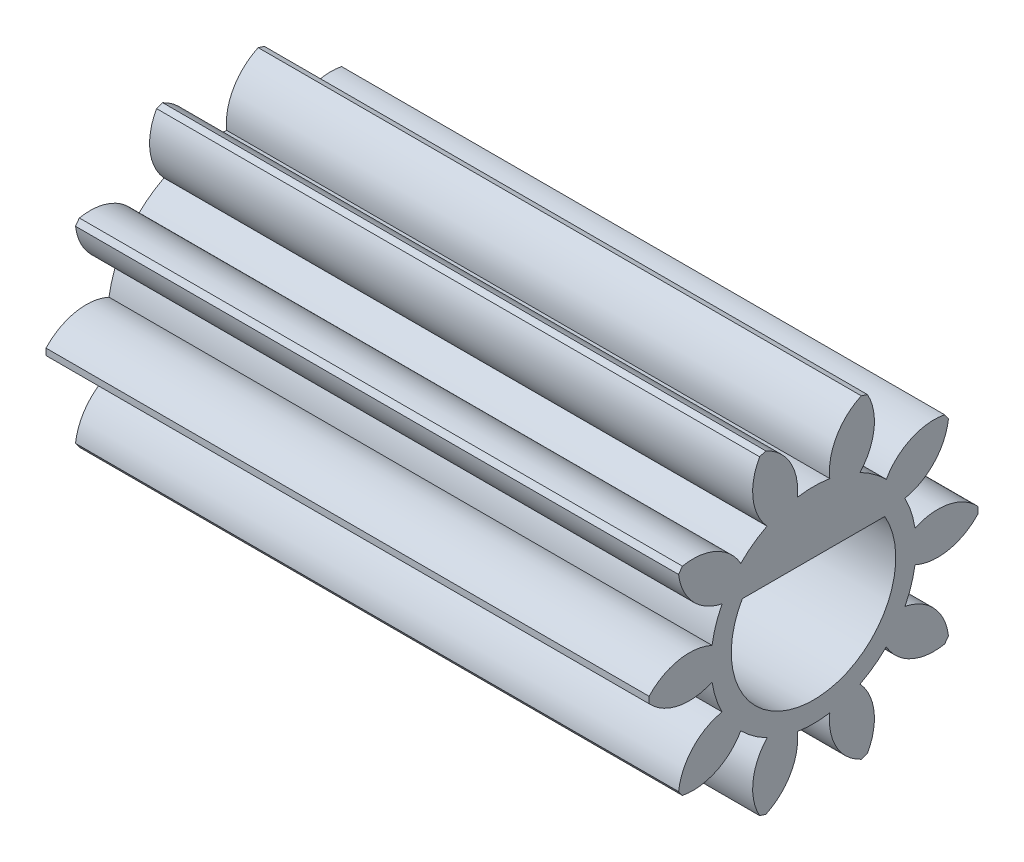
ISO-10303-21;
HEADER;
FILE_DESCRIPTION(('STEP AP214'),'2;1');
FILE_NAME('part.step','',(''),(''),'','','');
FILE_SCHEMA(('AUTOMOTIVE_DESIGN { 1 0 10303 214 1 1 1 1 }'));
ENDSEC;
DATA;
#1=APPLICATION_CONTEXT('core data for automotive mechanical design processes');
#2=APPLICATION_PROTOCOL_DEFINITION('international standard','automotive_design',2000,#1);
#3=PRODUCT_CONTEXT('',#1,'mechanical');
#4=PRODUCT('Part','Part','',(#3));
#5=PRODUCT_RELATED_PRODUCT_CATEGORY('part','',(#4));
#6=PRODUCT_DEFINITION_FORMATION('','',#4);
#7=PRODUCT_DEFINITION_CONTEXT('part definition',#1,'design');
#8=PRODUCT_DEFINITION('design','',#6,#7);
#9=PRODUCT_DEFINITION_SHAPE('','',#8);
#10=(LENGTH_UNIT() NAMED_UNIT(*) SI_UNIT(.MILLI.,.METRE.));
#11=(NAMED_UNIT(*) PLANE_ANGLE_UNIT() SI_UNIT($,.RADIAN.));
#12=(NAMED_UNIT(*) SI_UNIT($,.STERADIAN.) SOLID_ANGLE_UNIT());
#13=UNCERTAINTY_MEASURE_WITH_UNIT(LENGTH_MEASURE(1.E-05),#10,'distance_accuracy_value','');
#14=(GEOMETRIC_REPRESENTATION_CONTEXT(3) GLOBAL_UNCERTAINTY_ASSIGNED_CONTEXT((#13)) GLOBAL_UNIT_ASSIGNED_CONTEXT((#10,
#11,#12)) REPRESENTATION_CONTEXT('',''));
#15=CARTESIAN_POINT('',(0.,0.,0.));
#16=DIRECTION('',(0.,0.,1.));
#17=DIRECTION('',(1.,0.,0.));
#18=AXIS2_PLACEMENT_3D('',#15,#16,#17);
#19=CARTESIAN_POINT('',(11.,0.,0.));
#20=DIRECTION('',(-1.,0.,0.));
#21=DIRECTION('',(0.,0.,1.));
#22=AXIS2_PLACEMENT_3D('',#19,#20,#21);
#23=PLANE('',#22);
#24=CARTESIAN_POINT('',(11.,0.830089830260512,-2.19768964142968));
#25=DIRECTION('',(-1.,0.,0.));
#26=DIRECTION('',(0.,-0.587785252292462,-0.809016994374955));
#27=AXIS2_PLACEMENT_3D('',#24,#25,#26);
#28=CIRCLE('',#27,1.);
#29=CARTESIAN_POINT('',(11.,1.32275904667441,-1.32747297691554));
#30=VERTEX_POINT('',#29);
#31=CARTESIAN_POINT('',(11.,1.81110260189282,-2.39163278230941));
#32=VERTEX_POINT('',#31);
#33=EDGE_CURVE('E319',#30,#32,#28,.T.);
#34=ORIENTED_EDGE('',*,*,#33,.F.);
#35=CARTESIAN_POINT('',(11.,0.,0.));
#36=DIRECTION('',(-1.,0.,0.));
#37=DIRECTION('',(0.,-0.587785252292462,-0.809016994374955));
#38=AXIS2_PLACEMENT_3D('',#35,#36,#37);
#39=CIRCLE('',#38,1.874);
#40=CARTESIAN_POINT('',(11.,1.67125684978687,-0.84780690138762));
#41=VERTEX_POINT('',#40);
#42=EDGE_CURVE('E323',#41,#30,#39,.T.);
#43=ORIENTED_EDGE('',*,*,#42,.F.);
#44=CARTESIAN_POINT('',(11.,2.34663891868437,-0.110338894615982));
#45=DIRECTION('',(-1.,0.,0.));
#46=DIRECTION('',(0.,-0.587785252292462,-0.809016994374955));
#47=AXIS2_PLACEMENT_3D('',#44,#45,#46);
#48=CIRCLE('',#47,1.);
#49=CARTESIAN_POINT('',(11.,2.83423942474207,-0.983405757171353));
#50=VERTEX_POINT('',#49);
#51=EDGE_CURVE('E321',#50,#41,#48,.T.);
#52=ORIENTED_EDGE('',*,*,#51,.F.);
#53=CARTESIAN_POINT('',(11.,0.,0.));
#54=DIRECTION('',(-1.,0.,0.));
#55=DIRECTION('',(0.,0.,1.));
#56=AXIS2_PLACEMENT_3D('',#53,#54,#55);
#57=CIRCLE('',#56,3.);
#58=CARTESIAN_POINT('',(11.,2.87097926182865,-0.870332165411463));
#59=VERTEX_POINT('',#58);
#60=EDGE_CURVE('E539',#59,#50,#57,.T.);
#61=ORIENTED_EDGE('',*,*,#60,.F.);
#62=CARTESIAN_POINT('',(11.,1.96332633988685,-1.29005370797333));
#63=DIRECTION('',(-1.,0.,0.));
#64=DIRECTION('',(0.,0.,-1.));
#65=AXIS2_PLACEMENT_3D('',#62,#63,#64);
#66=CIRCLE('',#65,1.);
#67=CARTESIAN_POINT('',(11.,1.85040358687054,-0.296449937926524));
#68=VERTEX_POINT('',#67);
#69=EDGE_CURVE('E517',#68,#59,#66,.T.);
#70=ORIENTED_EDGE('',*,*,#69,.F.);
#71=CARTESIAN_POINT('',(11.,0.,0.));
#72=DIRECTION('',(-1.,0.,0.));
#73=DIRECTION('',(0.,0.,-1.));
#74=AXIS2_PLACEMENT_3D('',#71,#72,#73);
#75=CIRCLE('',#74,1.874);
#76=CARTESIAN_POINT('',(11.,1.85040358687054,0.296449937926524));
#77=VERTEX_POINT('',#76);
#78=EDGE_CURVE('E521',#77,#68,#75,.T.);
#79=ORIENTED_EDGE('',*,*,#78,.F.);
#80=CARTESIAN_POINT('',(11.,1.96332633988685,1.29005370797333));
#81=DIRECTION('',(-1.,0.,0.));
#82=DIRECTION('',(0.,0.,-1.));
#83=AXIS2_PLACEMENT_3D('',#80,#81,#82);
#84=CIRCLE('',#83,1.);
#85=CARTESIAN_POINT('',(11.,2.87097926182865,0.870332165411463));
#86=VERTEX_POINT('',#85);
#87=EDGE_CURVE('E519',#86,#77,#84,.T.);
#88=ORIENTED_EDGE('',*,*,#87,.F.);
#89=CARTESIAN_POINT('',(11.,2.83423942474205,0.983405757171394));
#90=VERTEX_POINT('',#89);
#91=EDGE_CURVE('E537',#90,#86,#57,.T.);
#92=ORIENTED_EDGE('',*,*,#91,.F.);
#93=CARTESIAN_POINT('',(11.,2.34663891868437,0.110338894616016));
#94=DIRECTION('',(-1.,0.,0.));
#95=DIRECTION('',(0.,0.587785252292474,-0.809016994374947));
#96=AXIS2_PLACEMENT_3D('',#93,#94,#95);
#97=CIRCLE('',#96,1.);
#98=CARTESIAN_POINT('',(11.,1.67125684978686,0.847806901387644));
#99=VERTEX_POINT('',#98);
#100=EDGE_CURVE('E495',#99,#90,#97,.T.);
#101=ORIENTED_EDGE('',*,*,#100,.F.);
#102=CARTESIAN_POINT('',(11.,0.,0.));
#103=DIRECTION('',(-1.,0.,0.));
#104=DIRECTION('',(0.,0.587785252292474,-0.809016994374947));
#105=AXIS2_PLACEMENT_3D('',#102,#103,#104);
#106=CIRCLE('',#105,1.874);
#107=CARTESIAN_POINT('',(11.,1.3227590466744,1.32747297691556));
#108=VERTEX_POINT('',#107);
#109=EDGE_CURVE('E499',#108,#99,#106,.T.);
#110=ORIENTED_EDGE('',*,*,#109,.F.);
#111=CARTESIAN_POINT('',(11.,0.83008983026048,2.19768964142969));
#112=DIRECTION('',(-1.,0.,0.));
#113=DIRECTION('',(0.,0.587785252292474,-0.809016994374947));
#114=AXIS2_PLACEMENT_3D('',#111,#112,#113);
#115=CIRCLE('',#114,1.);
#116=CARTESIAN_POINT('',(11.,1.81110260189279,2.39163278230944));
#117=VERTEX_POINT('',#116);
#118=EDGE_CURVE('E497',#117,#108,#115,.T.);
#119=ORIENTED_EDGE('',*,*,#118,.F.);
#120=CARTESIAN_POINT('',(11.,1.71491645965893,2.4615161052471));
#121=VERTEX_POINT('',#120);
#122=EDGE_CURVE('E609',#121,#117,#57,.T.);
#123=ORIENTED_EDGE('',*,*,#122,.F.);
#124=CARTESIAN_POINT('',(11.,1.83361518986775,1.46858578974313));
#125=DIRECTION('',(-1.,0.,0.));
#126=DIRECTION('',(0.,0.951056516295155,-0.309016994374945));
#127=AXIS2_PLACEMENT_3D('',#124,#125,#126);
#128=CIRCLE('',#127,1.);
#129=CARTESIAN_POINT('',(11.,0.853746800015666,1.66823032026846));
#130=VERTEX_POINT('',#129);
#131=EDGE_CURVE('E473',#130,#121,#128,.T.);
#132=ORIENTED_EDGE('',*,*,#131,.F.);
#133=CARTESIAN_POINT('',(11.,0.,0.));
#134=DIRECTION('',(-1.,0.,0.));
#135=DIRECTION('',(0.,0.951056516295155,-0.309016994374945));
#136=AXIS2_PLACEMENT_3D('',#133,#134,#135);
#137=CIRCLE('',#136,1.874);
#138=CARTESIAN_POINT('',(11.,0.289865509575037,1.85144645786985));
#139=VERTEX_POINT('',#138);
#140=EDGE_CURVE('E477',#139,#130,#137,.T.);
#141=ORIENTED_EDGE('',*,*,#140,.F.);
#142=CARTESIAN_POINT('',(11.,-0.620212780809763,2.26588282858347));
#143=DIRECTION('',(-1.,0.,0.));
#144=DIRECTION('',(0.,0.951056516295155,-0.309016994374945));
#145=AXIS2_PLACEMENT_3D('',#142,#143,#144);
#146=CIRCLE('',#145,1.);
#147=CARTESIAN_POINT('',(11.,0.0594463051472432,2.99941096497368));
#148=VERTEX_POINT('',#147);
#149=EDGE_CURVE('E475',#148,#139,#146,.T.);
#150=ORIENTED_EDGE('',*,*,#149,.F.);
#151=CARTESIAN_POINT('',(11.,-0.0594463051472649,2.99941096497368));
#152=VERTEX_POINT('',#151);
#153=EDGE_CURVE('E610',#152,#148,#57,.T.);
#154=ORIENTED_EDGE('',*,*,#153,.F.);
#155=CARTESIAN_POINT('',(11.,0.620212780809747,2.26588282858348));
#156=DIRECTION('',(-1.,0.,0.));
#157=DIRECTION('',(0.,0.951056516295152,0.309016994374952));
#158=AXIS2_PLACEMENT_3D('',#155,#156,#157);
#159=CIRCLE('',#158,1.);
#160=CARTESIAN_POINT('',(11.,-0.28986550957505,1.85144645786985));
#161=VERTEX_POINT('',#160);
#162=EDGE_CURVE('E451',#161,#152,#159,.T.);
#163=ORIENTED_EDGE('',*,*,#162,.F.);
#164=CARTESIAN_POINT('',(11.,0.,0.));
#165=DIRECTION('',(-1.,0.,0.));
#166=DIRECTION('',(0.,0.951056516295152,0.309016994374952));
#167=AXIS2_PLACEMENT_3D('',#164,#165,#166);
#168=CIRCLE('',#167,1.874);
#169=CARTESIAN_POINT('',(11.,-0.853746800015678,1.66823032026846));
#170=VERTEX_POINT('',#169);
#171=EDGE_CURVE('E455',#170,#161,#168,.T.);
#172=ORIENTED_EDGE('',*,*,#171,.F.);
#173=CARTESIAN_POINT('',(11.,-1.83361518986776,1.46858578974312));
#174=DIRECTION('',(-1.,0.,0.));
#175=DIRECTION('',(0.,0.951056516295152,0.309016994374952));
#176=AXIS2_PLACEMENT_3D('',#173,#174,#175);
#177=CIRCLE('',#176,1.);
#178=CARTESIAN_POINT('',(11.,-1.71491645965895,2.46151610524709));
#179=VERTEX_POINT('',#178);
#180=EDGE_CURVE('E453',#179,#170,#177,.T.);
#181=ORIENTED_EDGE('',*,*,#180,.F.);
#182=CARTESIAN_POINT('',(11.,-1.8111026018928,2.39163278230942));
#183=VERTEX_POINT('',#182);
#184=EDGE_CURVE('E614',#183,#179,#57,.T.);
#185=ORIENTED_EDGE('',*,*,#184,.F.);
#186=CARTESIAN_POINT('',(11.,-0.830089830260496,2.19768964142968));
#187=DIRECTION('',(-1.,0.,0.));
#188=DIRECTION('',(0.,0.587785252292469,0.809016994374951));
#189=AXIS2_PLACEMENT_3D('',#186,#187,#188);
#190=CIRCLE('',#189,1.);
#191=CARTESIAN_POINT('',(11.,-1.3227590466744,1.32747297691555));
#192=VERTEX_POINT('',#191);
#193=EDGE_CURVE('E429',#192,#183,#190,.T.);
#194=ORIENTED_EDGE('',*,*,#193,.F.);
#195=CARTESIAN_POINT('',(11.,0.,0.));
#196=DIRECTION('',(-1.,0.,0.));
#197=DIRECTION('',(0.,0.587785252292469,0.809016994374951));
#198=AXIS2_PLACEMENT_3D('',#195,#196,#197);
#199=CIRCLE('',#198,1.874);
#200=CARTESIAN_POINT('',(11.,-1.67125684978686,0.847806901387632));
#201=VERTEX_POINT('',#200);
#202=EDGE_CURVE('E433',#201,#192,#199,.T.);
#203=ORIENTED_EDGE('',*,*,#202,.F.);
#204=CARTESIAN_POINT('',(11.,-2.34663891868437,0.110338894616));
#205=DIRECTION('',(-1.,0.,0.));
#206=DIRECTION('',(0.,0.587785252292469,0.809016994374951));
#207=AXIS2_PLACEMENT_3D('',#204,#205,#206);
#208=CIRCLE('',#207,1.);
#209=CARTESIAN_POINT('',(11.,-2.83423942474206,0.983405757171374));
#210=VERTEX_POINT('',#209);
#211=EDGE_CURVE('E431',#210,#201,#208,.T.);
#212=ORIENTED_EDGE('',*,*,#211,.F.);
#213=CARTESIAN_POINT('',(11.,-2.87097926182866,0.870332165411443));
#214=VERTEX_POINT('',#213);
#215=EDGE_CURVE('E619',#214,#210,#57,.T.);
#216=ORIENTED_EDGE('',*,*,#215,.F.);
#217=CARTESIAN_POINT('',(11.,-1.96332633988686,1.29005370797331));
#218=DIRECTION('',(-1.,0.,0.));
#219=DIRECTION('',(0.,0.,1.));
#220=AXIS2_PLACEMENT_3D('',#217,#218,#219);
#221=CIRCLE('',#220,1.);
#222=CARTESIAN_POINT('',(11.,-1.85040358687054,0.296449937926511));
#223=VERTEX_POINT('',#222);
#224=EDGE_CURVE('E407',#223,#214,#221,.T.);
#225=ORIENTED_EDGE('',*,*,#224,.F.);
#226=CARTESIAN_POINT('',(11.,0.,0.));
#227=DIRECTION('',(-1.,0.,0.));
#228=DIRECTION('',(0.,0.,1.));
#229=AXIS2_PLACEMENT_3D('',#226,#227,#228);
#230=CIRCLE('',#229,1.874);
#231=CARTESIAN_POINT('',(11.,-1.85040358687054,-0.296449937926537));
#232=VERTEX_POINT('',#231);
#233=EDGE_CURVE('E411',#232,#223,#230,.T.);
#234=ORIENTED_EDGE('',*,*,#233,.F.);
#235=CARTESIAN_POINT('',(11.,-1.96332633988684,-1.29005370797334));
#236=DIRECTION('',(-1.,0.,0.));
#237=DIRECTION('',(0.,0.,1.));
#238=AXIS2_PLACEMENT_3D('',#235,#236,#237);
#239=CIRCLE('',#238,1.);
#240=CARTESIAN_POINT('',(11.,-2.87097926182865,-0.870332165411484));
#241=VERTEX_POINT('',#240);
#242=EDGE_CURVE('E409',#241,#232,#239,.T.);
#243=ORIENTED_EDGE('',*,*,#242,.F.);
#244=CARTESIAN_POINT('',(11.,-2.83423942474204,-0.983405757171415));
#245=VERTEX_POINT('',#244);
#246=EDGE_CURVE('E624',#245,#241,#57,.T.);
#247=ORIENTED_EDGE('',*,*,#246,.F.);
#248=CARTESIAN_POINT('',(11.,-2.34663891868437,-0.110338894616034));
#249=DIRECTION('',(-1.,0.,0.));
#250=DIRECTION('',(0.,-0.58778525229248,0.809016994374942));
#251=AXIS2_PLACEMENT_3D('',#248,#249,#250);
#252=CIRCLE('',#251,1.);
#253=CARTESIAN_POINT('',(11.,-1.67125684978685,-0.847806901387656));
#254=VERTEX_POINT('',#253);
#255=EDGE_CURVE('E385',#254,#245,#252,.T.);
#256=ORIENTED_EDGE('',*,*,#255,.F.);
#257=CARTESIAN_POINT('',(11.,0.,0.));
#258=DIRECTION('',(-1.,0.,0.));
#259=DIRECTION('',(0.,-0.58778525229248,0.809016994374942));
#260=AXIS2_PLACEMENT_3D('',#257,#258,#259);
#261=CIRCLE('',#260,1.874);
#262=CARTESIAN_POINT('',(11.,-1.32275904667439,-1.32747297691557));
#263=VERTEX_POINT('',#262);
#264=EDGE_CURVE('E389',#263,#254,#261,.T.);
#265=ORIENTED_EDGE('',*,*,#264,.F.);
#266=CARTESIAN_POINT('',(11.,-0.830089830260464,-2.19768964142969));
#267=DIRECTION('',(-1.,0.,0.));
#268=DIRECTION('',(0.,-0.58778525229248,0.809016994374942));
#269=AXIS2_PLACEMENT_3D('',#266,#267,#268);
#270=CIRCLE('',#269,1.);
#271=CARTESIAN_POINT('',(11.,-1.81110260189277,-2.39163278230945));
#272=VERTEX_POINT('',#271);
#273=EDGE_CURVE('E387',#272,#263,#270,.T.);
#274=ORIENTED_EDGE('',*,*,#273,.F.);
#275=CARTESIAN_POINT('',(11.,-1.71491645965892,-2.46151610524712));
#276=VERTEX_POINT('',#275);
#277=EDGE_CURVE('E629',#276,#272,#57,.T.);
#278=ORIENTED_EDGE('',*,*,#277,.F.);
#279=CARTESIAN_POINT('',(11.,-1.83361518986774,-1.46858578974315));
#280=DIRECTION('',(-1.,0.,0.));
#281=DIRECTION('',(0.,-0.951056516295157,0.309016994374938));
#282=AXIS2_PLACEMENT_3D('',#279,#280,#281);
#283=CIRCLE('',#282,1.);
#284=CARTESIAN_POINT('',(11.,-0.853746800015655,-1.66823032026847));
#285=VERTEX_POINT('',#284);
#286=EDGE_CURVE('E363',#285,#276,#283,.T.);
#287=ORIENTED_EDGE('',*,*,#286,.F.);
#288=CARTESIAN_POINT('',(11.,0.,0.));
#289=DIRECTION('',(-1.,0.,0.));
#290=DIRECTION('',(0.,-0.951056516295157,0.309016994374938));
#291=AXIS2_PLACEMENT_3D('',#288,#289,#290);
#292=CIRCLE('',#291,1.874);
#293=CARTESIAN_POINT('',(11.,-0.289865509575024,-1.85144645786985));
#294=VERTEX_POINT('',#293);
#295=EDGE_CURVE('E367',#294,#285,#292,.T.);
#296=ORIENTED_EDGE('',*,*,#295,.F.);
#297=CARTESIAN_POINT('',(11.,0.620212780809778,-2.26588282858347));
#298=DIRECTION('',(-1.,0.,0.));
#299=DIRECTION('',(0.,-0.951056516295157,0.309016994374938));
#300=AXIS2_PLACEMENT_3D('',#297,#298,#299);
#301=CIRCLE('',#300,1.);
#302=CARTESIAN_POINT('',(11.,-0.0594463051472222,-2.99941096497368));
#303=VERTEX_POINT('',#302);
#304=EDGE_CURVE('E365',#303,#294,#301,.T.);
#305=ORIENTED_EDGE('',*,*,#304,.F.);
#306=CARTESIAN_POINT('',(11.,0.0594463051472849,-2.99941096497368));
#307=VERTEX_POINT('',#306);
#308=EDGE_CURVE('E634',#307,#303,#57,.T.);
#309=ORIENTED_EDGE('',*,*,#308,.F.);
#310=CARTESIAN_POINT('',(11.,-0.62021278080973,-2.26588282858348));
#311=DIRECTION('',(-1.,0.,0.));
#312=DIRECTION('',(0.,-0.95105651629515,-0.309016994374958));
#313=AXIS2_PLACEMENT_3D('',#310,#311,#312);
#314=CIRCLE('',#313,1.);
#315=CARTESIAN_POINT('',(11.,0.289865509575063,-1.85144645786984));
#316=VERTEX_POINT('',#315);
#317=EDGE_CURVE('E341',#316,#307,#314,.T.);
#318=ORIENTED_EDGE('',*,*,#317,.F.);
#319=CARTESIAN_POINT('',(11.,0.,0.));
#320=DIRECTION('',(-1.,0.,0.));
#321=DIRECTION('',(0.,-0.95105651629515,-0.309016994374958));
#322=AXIS2_PLACEMENT_3D('',#319,#320,#321);
#323=CIRCLE('',#322,1.874);
#324=CARTESIAN_POINT('',(11.,0.85374680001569,-1.66823032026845));
#325=VERTEX_POINT('',#324);
#326=EDGE_CURVE('E345',#325,#316,#323,.T.);
#327=ORIENTED_EDGE('',*,*,#326,.F.);
#328=CARTESIAN_POINT('',(11.,1.83361518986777,-1.46858578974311));
#329=DIRECTION('',(-1.,0.,0.));
#330=DIRECTION('',(0.,-0.95105651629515,-0.309016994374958));
#331=AXIS2_PLACEMENT_3D('',#328,#329,#330);
#332=CIRCLE('',#331,1.);
#333=CARTESIAN_POINT('',(11.,1.71491645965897,-2.46151610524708));
#334=VERTEX_POINT('',#333);
#335=EDGE_CURVE('E343',#334,#325,#332,.T.);
#336=ORIENTED_EDGE('',*,*,#335,.F.);
#337=EDGE_CURVE('E543',#32,#334,#57,.T.);
#338=ORIENTED_EDGE('',*,*,#337,.F.);
#339=EDGE_LOOP('',(#34,#43,#52,#61,#70,#79,#88,#92,#101,#110,#119,#123,#132,#141,#150,#154,#163,
#172,#181,#185,#194,#203,#212,#216,#225,#234,#243,#247,#256,#265,#274,#278,#287,#296,#305,#309,
#318,#327,#336,#338));
#340=FACE_BOUND('',#339,.T.);
#341=CARTESIAN_POINT('',(11.,0.,0.));
#342=DIRECTION('',(-1.,0.,0.));
#343=DIRECTION('',(0.,0.,1.));
#344=AXIS2_PLACEMENT_3D('',#341,#342,#343);
#345=CIRCLE('',#344,1.5);
#346=CARTESIAN_POINT('',(11.,0.75,1.29903810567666));
#347=VERTEX_POINT('',#346);
#348=CARTESIAN_POINT('',(11.,0.75,-1.29903810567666));
#349=VERTEX_POINT('',#348);
#350=EDGE_CURVE('E300',#347,#349,#345,.F.);
#351=ORIENTED_EDGE('',*,*,#350,.F.);
#352=DIRECTION('',(0.,0.,1.));
#353=VECTOR('',#352,1.);
#354=CARTESIAN_POINT('',(11.,0.75,0.));
#355=LINE('',#354,#353);
#356=EDGE_CURVE('E296',#349,#347,#355,.T.);
#357=ORIENTED_EDGE('',*,*,#356,.F.);
#358=EDGE_LOOP('',(#351,#357));
#359=FACE_BOUND('',#358,.T.);
#360=ADVANCED_FACE('F32',(#340,#359),#23,.F.);
#361=CARTESIAN_POINT('',(0.,0.,0.));
#362=DIRECTION('',(1.,0.,0.));
#363=DIRECTION('',(0.,0.,-1.));
#364=AXIS2_PLACEMENT_3D('',#361,#362,#363);
#365=PLANE('',#364);
#366=CARTESIAN_POINT('',(0.,0.830089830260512,-2.19768964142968));
#367=DIRECTION('',(-1.,0.,0.));
#368=DIRECTION('',(0.,-0.587785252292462,-0.809016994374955));
#369=AXIS2_PLACEMENT_3D('',#366,#367,#368);
#370=CIRCLE('',#369,1.);
#371=CARTESIAN_POINT('',(0.,1.32275904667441,-1.32747297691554));
#372=VERTEX_POINT('',#371);
#373=CARTESIAN_POINT('',(0.,1.81110260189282,-2.39163278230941));
#374=VERTEX_POINT('',#373);
#375=EDGE_CURVE('E308',#372,#374,#370,.T.);
#376=ORIENTED_EDGE('',*,*,#375,.T.);
#377=CARTESIAN_POINT('',(0.,0.,0.));
#378=DIRECTION('',(-1.,0.,0.));
#379=DIRECTION('',(0.,0.,1.));
#380=AXIS2_PLACEMENT_3D('',#377,#378,#379);
#381=CIRCLE('',#380,3.);
#382=CARTESIAN_POINT('',(0.,1.71491645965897,-2.46151610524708));
#383=VERTEX_POINT('',#382);
#384=EDGE_CURVE('E538',#374,#383,#381,.T.);
#385=ORIENTED_EDGE('',*,*,#384,.T.);
#386=CARTESIAN_POINT('',(0.,1.83361518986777,-1.46858578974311));
#387=DIRECTION('',(1.,0.,0.));
#388=DIRECTION('',(0.,0.,-1.));
#389=AXIS2_PLACEMENT_3D('',#386,#387,#388);
#390=CIRCLE('',#389,1.);
#391=CARTESIAN_POINT('',(0.,0.85374680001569,-1.66823032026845));
#392=VERTEX_POINT('',#391);
#393=EDGE_CURVE('E567',#392,#383,#390,.T.);
#394=ORIENTED_EDGE('',*,*,#393,.F.);
#395=CARTESIAN_POINT('',(0.,0.,0.));
#396=DIRECTION('',(-1.,0.,0.));
#397=DIRECTION('',(0.,-0.95105651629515,-0.309016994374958));
#398=AXIS2_PLACEMENT_3D('',#395,#396,#397);
#399=CIRCLE('',#398,1.874);
#400=CARTESIAN_POINT('',(0.,0.289865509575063,-1.85144645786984));
#401=VERTEX_POINT('',#400);
#402=EDGE_CURVE('E338',#392,#401,#399,.T.);
#403=ORIENTED_EDGE('',*,*,#402,.T.);
#404=CARTESIAN_POINT('',(0.,-0.62021278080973,-2.26588282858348));
#405=DIRECTION('',(-1.,0.,0.));
#406=DIRECTION('',(0.,-0.95105651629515,-0.309016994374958));
#407=AXIS2_PLACEMENT_3D('',#404,#405,#406);
#408=CIRCLE('',#407,1.);
#409=CARTESIAN_POINT('',(0.,0.0594463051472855,-2.99941096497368));
#410=VERTEX_POINT('',#409);
#411=EDGE_CURVE('E335',#401,#410,#408,.T.);
#412=ORIENTED_EDGE('',*,*,#411,.T.);
#413=CARTESIAN_POINT('',(0.,-0.0594463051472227,-2.99941096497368));
#414=VERTEX_POINT('',#413);
#415=EDGE_CURVE('E662',#410,#414,#381,.T.);
#416=ORIENTED_EDGE('',*,*,#415,.T.);
#417=CARTESIAN_POINT('',(0.,0.620212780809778,-2.26588282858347));
#418=DIRECTION('',(1.,0.,0.));
#419=DIRECTION('',(0.,0.,-1.));
#420=AXIS2_PLACEMENT_3D('',#417,#418,#419);
#421=CIRCLE('',#420,1.);
#422=CARTESIAN_POINT('',(0.,-0.289865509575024,-1.85144645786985));
#423=VERTEX_POINT('',#422);
#424=EDGE_CURVE('E564',#423,#414,#421,.T.);
#425=ORIENTED_EDGE('',*,*,#424,.F.);
#426=CARTESIAN_POINT('',(0.,0.,0.));
#427=DIRECTION('',(-1.,0.,0.));
#428=DIRECTION('',(0.,-0.951056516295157,0.309016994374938));
#429=AXIS2_PLACEMENT_3D('',#426,#427,#428);
#430=CIRCLE('',#429,1.874);
#431=CARTESIAN_POINT('',(0.,-0.853746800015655,-1.66823032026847));
#432=VERTEX_POINT('',#431);
#433=EDGE_CURVE('E360',#423,#432,#430,.T.);
#434=ORIENTED_EDGE('',*,*,#433,.T.);
#435=CARTESIAN_POINT('',(0.,-1.83361518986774,-1.46858578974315));
#436=DIRECTION('',(-1.,0.,0.));
#437=DIRECTION('',(0.,-0.951056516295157,0.309016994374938));
#438=AXIS2_PLACEMENT_3D('',#435,#436,#437);
#439=CIRCLE('',#438,1.);
#440=CARTESIAN_POINT('',(0.,-1.71491645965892,-2.46151610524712));
#441=VERTEX_POINT('',#440);
#442=EDGE_CURVE('E357',#432,#441,#439,.T.);
#443=ORIENTED_EDGE('',*,*,#442,.T.);
#444=CARTESIAN_POINT('',(0.,-1.81110260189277,-2.39163278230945));
#445=VERTEX_POINT('',#444);
#446=EDGE_CURVE('E664',#441,#445,#381,.T.);
#447=ORIENTED_EDGE('',*,*,#446,.T.);
#448=CARTESIAN_POINT('',(0.,-0.830089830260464,-2.19768964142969));
#449=DIRECTION('',(1.,0.,0.));
#450=DIRECTION('',(0.,0.,-1.));
#451=AXIS2_PLACEMENT_3D('',#448,#449,#450);
#452=CIRCLE('',#451,1.);
#453=CARTESIAN_POINT('',(0.,-1.32275904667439,-1.32747297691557));
#454=VERTEX_POINT('',#453);
#455=EDGE_CURVE('E561',#454,#445,#452,.T.);
#456=ORIENTED_EDGE('',*,*,#455,.F.);
#457=CARTESIAN_POINT('',(0.,0.,0.));
#458=DIRECTION('',(-1.,0.,0.));
#459=DIRECTION('',(0.,-0.58778525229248,0.809016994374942));
#460=AXIS2_PLACEMENT_3D('',#457,#458,#459);
#461=CIRCLE('',#460,1.874);
#462=CARTESIAN_POINT('',(0.,-1.67125684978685,-0.847806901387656));
#463=VERTEX_POINT('',#462);
#464=EDGE_CURVE('E382',#454,#463,#461,.T.);
#465=ORIENTED_EDGE('',*,*,#464,.T.);
#466=CARTESIAN_POINT('',(0.,-2.34663891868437,-0.110338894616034));
#467=DIRECTION('',(-1.,0.,0.));
#468=DIRECTION('',(0.,-0.58778525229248,0.809016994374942));
#469=AXIS2_PLACEMENT_3D('',#466,#467,#468);
#470=CIRCLE('',#469,1.);
#471=CARTESIAN_POINT('',(0.,-2.83423942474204,-0.983405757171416));
#472=VERTEX_POINT('',#471);
#473=EDGE_CURVE('E379',#463,#472,#470,.T.);
#474=ORIENTED_EDGE('',*,*,#473,.T.);
#475=CARTESIAN_POINT('',(0.,-2.87097926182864,-0.870332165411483));
#476=VERTEX_POINT('',#475);
#477=EDGE_CURVE('E665',#472,#476,#381,.T.);
#478=ORIENTED_EDGE('',*,*,#477,.T.);
#479=CARTESIAN_POINT('',(0.,-1.96332633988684,-1.29005370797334));
#480=DIRECTION('',(1.,0.,0.));
#481=DIRECTION('',(0.,0.,-1.));
#482=AXIS2_PLACEMENT_3D('',#479,#480,#481);
#483=CIRCLE('',#482,1.);
#484=CARTESIAN_POINT('',(0.,-1.85040358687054,-0.296449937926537));
#485=VERTEX_POINT('',#484);
#486=EDGE_CURVE('E558',#485,#476,#483,.T.);
#487=ORIENTED_EDGE('',*,*,#486,.F.);
#488=CARTESIAN_POINT('',(0.,0.,0.));
#489=DIRECTION('',(-1.,0.,0.));
#490=DIRECTION('',(0.,0.,1.));
#491=AXIS2_PLACEMENT_3D('',#488,#489,#490);
#492=CIRCLE('',#491,1.874);
#493=CARTESIAN_POINT('',(0.,-1.85040358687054,0.296449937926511));
#494=VERTEX_POINT('',#493);
#495=EDGE_CURVE('E404',#485,#494,#492,.T.);
#496=ORIENTED_EDGE('',*,*,#495,.T.);
#497=CARTESIAN_POINT('',(0.,-1.96332633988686,1.29005370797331));
#498=DIRECTION('',(-1.,0.,0.));
#499=DIRECTION('',(0.,0.,1.));
#500=AXIS2_PLACEMENT_3D('',#497,#498,#499);
#501=CIRCLE('',#500,1.);
#502=CARTESIAN_POINT('',(0.,-2.87097926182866,0.870332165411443));
#503=VERTEX_POINT('',#502);
#504=EDGE_CURVE('E401',#494,#503,#501,.T.);
#505=ORIENTED_EDGE('',*,*,#504,.T.);
#506=CARTESIAN_POINT('',(0.,-2.83423942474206,0.983405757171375));
#507=VERTEX_POINT('',#506);
#508=EDGE_CURVE('E668',#503,#507,#381,.T.);
#509=ORIENTED_EDGE('',*,*,#508,.T.);
#510=CARTESIAN_POINT('',(0.,-2.34663891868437,0.110338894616));
#511=DIRECTION('',(1.,0.,0.));
#512=DIRECTION('',(0.,0.,-1.));
#513=AXIS2_PLACEMENT_3D('',#510,#511,#512);
#514=CIRCLE('',#513,1.);
#515=CARTESIAN_POINT('',(0.,-1.67125684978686,0.847806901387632));
#516=VERTEX_POINT('',#515);
#517=EDGE_CURVE('E555',#516,#507,#514,.T.);
#518=ORIENTED_EDGE('',*,*,#517,.F.);
#519=CARTESIAN_POINT('',(0.,0.,0.));
#520=DIRECTION('',(-1.,0.,0.));
#521=DIRECTION('',(0.,0.587785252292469,0.809016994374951));
#522=AXIS2_PLACEMENT_3D('',#519,#520,#521);
#523=CIRCLE('',#522,1.874);
#524=CARTESIAN_POINT('',(0.,-1.3227590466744,1.32747297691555));
#525=VERTEX_POINT('',#524);
#526=EDGE_CURVE('E426',#516,#525,#523,.T.);
#527=ORIENTED_EDGE('',*,*,#526,.T.);
#528=CARTESIAN_POINT('',(0.,-0.830089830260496,2.19768964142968));
#529=DIRECTION('',(-1.,0.,0.));
#530=DIRECTION('',(0.,0.587785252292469,0.809016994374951));
#531=AXIS2_PLACEMENT_3D('',#528,#529,#530);
#532=CIRCLE('',#531,1.);
#533=CARTESIAN_POINT('',(0.,-1.8111026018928,2.39163278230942));
#534=VERTEX_POINT('',#533);
#535=EDGE_CURVE('E423',#525,#534,#532,.T.);
#536=ORIENTED_EDGE('',*,*,#535,.T.);
#537=CARTESIAN_POINT('',(0.,-1.71491645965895,2.46151610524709));
#538=VERTEX_POINT('',#537);
#539=EDGE_CURVE('E671',#534,#538,#381,.T.);
#540=ORIENTED_EDGE('',*,*,#539,.T.);
#541=CARTESIAN_POINT('',(0.,-1.83361518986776,1.46858578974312));
#542=DIRECTION('',(1.,0.,0.));
#543=DIRECTION('',(0.,0.,-1.));
#544=AXIS2_PLACEMENT_3D('',#541,#542,#543);
#545=CIRCLE('',#544,1.);
#546=CARTESIAN_POINT('',(0.,-0.853746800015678,1.66823032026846));
#547=VERTEX_POINT('',#546);
#548=EDGE_CURVE('E552',#547,#538,#545,.T.);
#549=ORIENTED_EDGE('',*,*,#548,.F.);
#550=CARTESIAN_POINT('',(0.,0.,0.));
#551=DIRECTION('',(-1.,0.,0.));
#552=DIRECTION('',(0.,0.951056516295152,0.309016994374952));
#553=AXIS2_PLACEMENT_3D('',#550,#551,#552);
#554=CIRCLE('',#553,1.874);
#555=CARTESIAN_POINT('',(0.,-0.28986550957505,1.85144645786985));
#556=VERTEX_POINT('',#555);
#557=EDGE_CURVE('E448',#547,#556,#554,.T.);
#558=ORIENTED_EDGE('',*,*,#557,.T.);
#559=CARTESIAN_POINT('',(0.,0.620212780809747,2.26588282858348));
#560=DIRECTION('',(-1.,0.,0.));
#561=DIRECTION('',(0.,0.951056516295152,0.309016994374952));
#562=AXIS2_PLACEMENT_3D('',#559,#560,#561);
#563=CIRCLE('',#562,1.);
#564=CARTESIAN_POINT('',(0.,-0.0594463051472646,2.99941096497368));
#565=VERTEX_POINT('',#564);
#566=EDGE_CURVE('E445',#556,#565,#563,.T.);
#567=ORIENTED_EDGE('',*,*,#566,.T.);
#568=CARTESIAN_POINT('',(0.,0.0594463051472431,2.99941096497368));
#569=VERTEX_POINT('',#568);
#570=EDGE_CURVE('E674',#565,#569,#381,.T.);
#571=ORIENTED_EDGE('',*,*,#570,.T.);
#572=CARTESIAN_POINT('',(0.,-0.620212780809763,2.26588282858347));
#573=DIRECTION('',(1.,0.,0.));
#574=DIRECTION('',(0.,0.,-1.));
#575=AXIS2_PLACEMENT_3D('',#572,#573,#574);
#576=CIRCLE('',#575,1.);
#577=CARTESIAN_POINT('',(0.,0.289865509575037,1.85144645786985));
#578=VERTEX_POINT('',#577);
#579=EDGE_CURVE('E549',#578,#569,#576,.T.);
#580=ORIENTED_EDGE('',*,*,#579,.F.);
#581=CARTESIAN_POINT('',(0.,0.,0.));
#582=DIRECTION('',(-1.,0.,0.));
#583=DIRECTION('',(0.,0.951056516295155,-0.309016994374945));
#584=AXIS2_PLACEMENT_3D('',#581,#582,#583);
#585=CIRCLE('',#584,1.874);
#586=CARTESIAN_POINT('',(0.,0.853746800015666,1.66823032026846));
#587=VERTEX_POINT('',#586);
#588=EDGE_CURVE('E470',#578,#587,#585,.T.);
#589=ORIENTED_EDGE('',*,*,#588,.T.);
#590=CARTESIAN_POINT('',(0.,1.83361518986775,1.46858578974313));
#591=DIRECTION('',(-1.,0.,0.));
#592=DIRECTION('',(0.,0.951056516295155,-0.309016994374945));
#593=AXIS2_PLACEMENT_3D('',#590,#591,#592);
#594=CIRCLE('',#593,1.);
#595=CARTESIAN_POINT('',(0.,1.71491645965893,2.4615161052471));
#596=VERTEX_POINT('',#595);
#597=EDGE_CURVE('E467',#587,#596,#594,.T.);
#598=ORIENTED_EDGE('',*,*,#597,.T.);
#599=CARTESIAN_POINT('',(0.,1.81110260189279,2.39163278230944));
#600=VERTEX_POINT('',#599);
#601=EDGE_CURVE('E677',#596,#600,#381,.T.);
#602=ORIENTED_EDGE('',*,*,#601,.T.);
#603=CARTESIAN_POINT('',(0.,0.83008983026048,2.19768964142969));
#604=DIRECTION('',(1.,0.,0.));
#605=DIRECTION('',(0.,0.,-1.));
#606=AXIS2_PLACEMENT_3D('',#603,#604,#605);
#607=CIRCLE('',#606,1.);
#608=CARTESIAN_POINT('',(0.,1.3227590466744,1.32747297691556));
#609=VERTEX_POINT('',#608);
#610=EDGE_CURVE('E546',#609,#600,#607,.T.);
#611=ORIENTED_EDGE('',*,*,#610,.F.);
#612=CARTESIAN_POINT('',(0.,0.,0.));
#613=DIRECTION('',(-1.,0.,0.));
#614=DIRECTION('',(0.,0.587785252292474,-0.809016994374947));
#615=AXIS2_PLACEMENT_3D('',#612,#613,#614);
#616=CIRCLE('',#615,1.874);
#617=CARTESIAN_POINT('',(0.,1.67125684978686,0.847806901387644));
#618=VERTEX_POINT('',#617);
#619=EDGE_CURVE('E492',#609,#618,#616,.T.);
#620=ORIENTED_EDGE('',*,*,#619,.T.);
#621=CARTESIAN_POINT('',(0.,2.34663891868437,0.110338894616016));
#622=DIRECTION('',(-1.,0.,0.));
#623=DIRECTION('',(0.,0.587785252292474,-0.809016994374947));
#624=AXIS2_PLACEMENT_3D('',#621,#622,#623);
#625=CIRCLE('',#624,1.);
#626=CARTESIAN_POINT('',(0.,2.83423942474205,0.983405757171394));
#627=VERTEX_POINT('',#626);
#628=EDGE_CURVE('E489',#618,#627,#625,.T.);
#629=ORIENTED_EDGE('',*,*,#628,.T.);
#630=CARTESIAN_POINT('',(0.,2.87097926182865,0.870332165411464));
#631=VERTEX_POINT('',#630);
#632=EDGE_CURVE('E533',#627,#631,#381,.T.);
#633=ORIENTED_EDGE('',*,*,#632,.T.);
#634=CARTESIAN_POINT('',(0.,1.96332633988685,1.29005370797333));
#635=DIRECTION('',(1.,0.,0.));
#636=DIRECTION('',(0.,0.,-1.));
#637=AXIS2_PLACEMENT_3D('',#634,#635,#636);
#638=CIRCLE('',#637,1.);
#639=CARTESIAN_POINT('',(0.,1.85040358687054,0.296449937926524));
#640=VERTEX_POINT('',#639);
#641=EDGE_CURVE('E542',#640,#631,#638,.T.);
#642=ORIENTED_EDGE('',*,*,#641,.F.);
#643=CARTESIAN_POINT('',(0.,0.,0.));
#644=DIRECTION('',(-1.,0.,0.));
#645=DIRECTION('',(0.,0.,-1.));
#646=AXIS2_PLACEMENT_3D('',#643,#644,#645);
#647=CIRCLE('',#646,1.874);
#648=CARTESIAN_POINT('',(0.,1.85040358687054,-0.296449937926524));
#649=VERTEX_POINT('',#648);
#650=EDGE_CURVE('E514',#640,#649,#647,.T.);
#651=ORIENTED_EDGE('',*,*,#650,.T.);
#652=CARTESIAN_POINT('',(0.,1.96332633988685,-1.29005370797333));
#653=DIRECTION('',(-1.,0.,0.));
#654=DIRECTION('',(0.,0.,-1.));
#655=AXIS2_PLACEMENT_3D('',#652,#653,#654);
#656=CIRCLE('',#655,1.);
#657=CARTESIAN_POINT('',(0.,2.87097926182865,-0.870332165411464));
#658=VERTEX_POINT('',#657);
#659=EDGE_CURVE('E511',#649,#658,#656,.T.);
#660=ORIENTED_EDGE('',*,*,#659,.T.);
#661=CARTESIAN_POINT('',(0.,2.83423942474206,-0.983405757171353));
#662=VERTEX_POINT('',#661);
#663=EDGE_CURVE('E534',#658,#662,#381,.T.);
#664=ORIENTED_EDGE('',*,*,#663,.T.);
#665=CARTESIAN_POINT('',(0.,2.34663891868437,-0.110338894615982));
#666=DIRECTION('',(1.,0.,0.));
#667=DIRECTION('',(0.,0.,-1.));
#668=AXIS2_PLACEMENT_3D('',#665,#666,#667);
#669=CIRCLE('',#668,1.);
#670=CARTESIAN_POINT('',(0.,1.67125684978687,-0.84780690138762));
#671=VERTEX_POINT('',#670);
#672=EDGE_CURVE('E570',#671,#662,#669,.T.);
#673=ORIENTED_EDGE('',*,*,#672,.F.);
#674=CARTESIAN_POINT('',(0.,0.,0.));
#675=DIRECTION('',(-1.,0.,0.));
#676=DIRECTION('',(0.,-0.587785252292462,-0.809016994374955));
#677=AXIS2_PLACEMENT_3D('',#674,#675,#676);
#678=CIRCLE('',#677,1.874);
#679=EDGE_CURVE('E313',#671,#372,#678,.T.);
#680=ORIENTED_EDGE('',*,*,#679,.T.);
#681=EDGE_LOOP('',(#376,#385,#394,#403,#412,#416,#425,#434,#443,#447,#456,#465,#474,#478,#487,
#496,#505,#509,#518,#527,#536,#540,#549,#558,#567,#571,#580,#589,#598,#602,#611,#620,#629,#633,
#642,#651,#660,#664,#673,#680));
#682=FACE_BOUND('',#681,.T.);
#683=CARTESIAN_POINT('',(0.,0.,0.));
#684=DIRECTION('',(1.,0.,0.));
#685=DIRECTION('',(0.,0.,-1.));
#686=AXIS2_PLACEMENT_3D('',#683,#684,#685);
#687=CIRCLE('',#686,1.5);
#688=CARTESIAN_POINT('',(0.,0.75,-1.29903810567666));
#689=VERTEX_POINT('',#688);
#690=CARTESIAN_POINT('',(0.,0.75,1.29903810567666));
#691=VERTEX_POINT('',#690);
#692=EDGE_CURVE('E11',#689,#691,#687,.F.);
#693=ORIENTED_EDGE('',*,*,#692,.F.);
#694=DIRECTION('',(0.,0.,-1.));
#695=VECTOR('',#694,1.);
#696=CARTESIAN_POINT('',(0.,0.75,0.));
#697=LINE('',#696,#695);
#698=EDGE_CURVE('E39',#691,#689,#697,.T.);
#699=ORIENTED_EDGE('',*,*,#698,.F.);
#700=EDGE_LOOP('',(#693,#699));
#701=FACE_BOUND('',#700,.T.);
#702=ADVANCED_FACE('F572',(#682,#701),#365,.F.);
#703=CARTESIAN_POINT('',(-10.,0.,0.));
#704=DIRECTION('',(-1.,0.,0.));
#705=DIRECTION('',(0.,0.,1.));
#706=AXIS2_PLACEMENT_3D('',#703,#704,#705);
#707=CYLINDRICAL_SURFACE('',#706,3.);
#708=DIRECTION('',(-1.,0.,0.));
#709=VECTOR('',#708,1.);
#710=CARTESIAN_POINT('',(5.5,1.81110260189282,-2.39163278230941));
#711=LINE('',#710,#709);
#712=EDGE_CURVE('E332',#32,#374,#711,.T.);
#713=ORIENTED_EDGE('',*,*,#712,.F.);
#714=ORIENTED_EDGE('',*,*,#337,.T.);
#715=DIRECTION('',(-1.,0.,0.));
#716=VECTOR('',#715,1.);
#717=CARTESIAN_POINT('',(5.5,1.71491645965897,-2.46151610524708));
#718=LINE('',#717,#716);
#719=EDGE_CURVE('E352',#383,#334,#718,.F.);
#720=ORIENTED_EDGE('',*,*,#719,.F.);
#721=ORIENTED_EDGE('',*,*,#384,.F.);
#722=EDGE_LOOP('',(#713,#714,#720,#721));
#723=FACE_BOUND('',#722,.T.);
#724=ADVANCED_FACE('F574',(#723),#707,.T.);
#725=DIRECTION('',(-1.,0.,0.));
#726=VECTOR('',#725,1.);
#727=CARTESIAN_POINT('',(5.5,2.83423942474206,-0.983405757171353));
#728=LINE('',#727,#726);
#729=EDGE_CURVE('E330',#662,#50,#728,.F.);
#730=ORIENTED_EDGE('',*,*,#729,.F.);
#731=ORIENTED_EDGE('',*,*,#663,.F.);
#732=DIRECTION('',(-1.,0.,0.));
#733=VECTOR('',#732,1.);
#734=CARTESIAN_POINT('',(5.5,2.87097926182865,-0.870332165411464));
#735=LINE('',#734,#733);
#736=EDGE_CURVE('E531',#59,#658,#735,.T.);
#737=ORIENTED_EDGE('',*,*,#736,.F.);
#738=ORIENTED_EDGE('',*,*,#60,.T.);
#739=EDGE_LOOP('',(#730,#731,#737,#738));
#740=FACE_BOUND('',#739,.T.);
#741=ADVANCED_FACE('F581',(#740),#707,.T.);
#742=DIRECTION('',(-1.,0.,0.));
#743=VECTOR('',#742,1.);
#744=CARTESIAN_POINT('',(5.5,0.0594463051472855,-2.99941096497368));
#745=LINE('',#744,#743);
#746=EDGE_CURVE('E355',#307,#410,#745,.T.);
#747=ORIENTED_EDGE('',*,*,#746,.F.);
#748=ORIENTED_EDGE('',*,*,#308,.T.);
#749=DIRECTION('',(-1.,0.,0.));
#750=VECTOR('',#749,1.);
#751=CARTESIAN_POINT('',(5.5,-0.0594463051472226,-2.99941096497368));
#752=LINE('',#751,#750);
#753=EDGE_CURVE('E374',#414,#303,#752,.F.);
#754=ORIENTED_EDGE('',*,*,#753,.F.);
#755=ORIENTED_EDGE('',*,*,#415,.F.);
#756=EDGE_LOOP('',(#747,#748,#754,#755));
#757=FACE_BOUND('',#756,.T.);
#758=ADVANCED_FACE('F663',(#757),#707,.T.);
#759=DIRECTION('',(-1.,0.,0.));
#760=VECTOR('',#759,1.);
#761=CARTESIAN_POINT('',(5.5,-1.71491645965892,-2.46151610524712));
#762=LINE('',#761,#760);
#763=EDGE_CURVE('E377',#276,#441,#762,.T.);
#764=ORIENTED_EDGE('',*,*,#763,.F.);
#765=ORIENTED_EDGE('',*,*,#277,.T.);
#766=DIRECTION('',(-1.,0.,0.));
#767=VECTOR('',#766,1.);
#768=CARTESIAN_POINT('',(5.5,-1.81110260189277,-2.39163278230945));
#769=LINE('',#768,#767);
#770=EDGE_CURVE('E396',#445,#272,#769,.F.);
#771=ORIENTED_EDGE('',*,*,#770,.F.);
#772=ORIENTED_EDGE('',*,*,#446,.F.);
#773=EDGE_LOOP('',(#764,#765,#771,#772));
#774=FACE_BOUND('',#773,.T.);
#775=ADVANCED_FACE('F1026',(#774),#707,.T.);
#776=DIRECTION('',(-1.,0.,0.));
#777=VECTOR('',#776,1.);
#778=CARTESIAN_POINT('',(5.5,-2.83423942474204,-0.983405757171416));
#779=LINE('',#778,#777);
#780=EDGE_CURVE('E399',#245,#472,#779,.T.);
#781=ORIENTED_EDGE('',*,*,#780,.F.);
#782=ORIENTED_EDGE('',*,*,#246,.T.);
#783=DIRECTION('',(-1.,0.,0.));
#784=VECTOR('',#783,1.);
#785=CARTESIAN_POINT('',(5.5,-2.87097926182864,-0.870332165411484));
#786=LINE('',#785,#784);
#787=EDGE_CURVE('E418',#476,#241,#786,.F.);
#788=ORIENTED_EDGE('',*,*,#787,.F.);
#789=ORIENTED_EDGE('',*,*,#477,.F.);
#790=EDGE_LOOP('',(#781,#782,#788,#789));
#791=FACE_BOUND('',#790,.T.);
#792=ADVANCED_FACE('F1033',(#791),#707,.T.);
#793=DIRECTION('',(-1.,0.,0.));
#794=VECTOR('',#793,1.);
#795=CARTESIAN_POINT('',(5.5,-2.87097926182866,0.870332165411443));
#796=LINE('',#795,#794);
#797=EDGE_CURVE('E421',#214,#503,#796,.T.);
#798=ORIENTED_EDGE('',*,*,#797,.F.);
#799=ORIENTED_EDGE('',*,*,#215,.T.);
#800=DIRECTION('',(-1.,0.,0.));
#801=VECTOR('',#800,1.);
#802=CARTESIAN_POINT('',(5.5,-2.83423942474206,0.983405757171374));
#803=LINE('',#802,#801);
#804=EDGE_CURVE('E440',#507,#210,#803,.F.);
#805=ORIENTED_EDGE('',*,*,#804,.F.);
#806=ORIENTED_EDGE('',*,*,#508,.F.);
#807=EDGE_LOOP('',(#798,#799,#805,#806));
#808=FACE_BOUND('',#807,.T.);
#809=ADVANCED_FACE('F1040',(#808),#707,.T.);
#810=DIRECTION('',(-1.,0.,0.));
#811=VECTOR('',#810,1.);
#812=CARTESIAN_POINT('',(5.5,-1.8111026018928,2.39163278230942));
#813=LINE('',#812,#811);
#814=EDGE_CURVE('E443',#183,#534,#813,.T.);
#815=ORIENTED_EDGE('',*,*,#814,.F.);
#816=ORIENTED_EDGE('',*,*,#184,.T.);
#817=DIRECTION('',(-1.,0.,0.));
#818=VECTOR('',#817,1.);
#819=CARTESIAN_POINT('',(5.5,-1.71491645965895,2.46151610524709));
#820=LINE('',#819,#818);
#821=EDGE_CURVE('E462',#538,#179,#820,.F.);
#822=ORIENTED_EDGE('',*,*,#821,.F.);
#823=ORIENTED_EDGE('',*,*,#539,.F.);
#824=EDGE_LOOP('',(#815,#816,#822,#823));
#825=FACE_BOUND('',#824,.T.);
#826=ADVANCED_FACE('F1047',(#825),#707,.T.);
#827=DIRECTION('',(-1.,0.,0.));
#828=VECTOR('',#827,1.);
#829=CARTESIAN_POINT('',(5.5,-0.0594463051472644,2.99941096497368));
#830=LINE('',#829,#828);
#831=EDGE_CURVE('E465',#152,#565,#830,.T.);
#832=ORIENTED_EDGE('',*,*,#831,.F.);
#833=ORIENTED_EDGE('',*,*,#153,.T.);
#834=DIRECTION('',(-1.,0.,0.));
#835=VECTOR('',#834,1.);
#836=CARTESIAN_POINT('',(5.5,0.0594463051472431,2.99941096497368));
#837=LINE('',#836,#835);
#838=EDGE_CURVE('E484',#569,#148,#837,.F.);
#839=ORIENTED_EDGE('',*,*,#838,.F.);
#840=ORIENTED_EDGE('',*,*,#570,.F.);
#841=EDGE_LOOP('',(#832,#833,#839,#840));
#842=FACE_BOUND('',#841,.T.);
#843=ADVANCED_FACE('F597',(#842),#707,.T.);
#844=DIRECTION('',(-1.,0.,0.));
#845=VECTOR('',#844,1.);
#846=CARTESIAN_POINT('',(5.5,1.71491645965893,2.4615161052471));
#847=LINE('',#846,#845);
#848=EDGE_CURVE('E487',#121,#596,#847,.T.);
#849=ORIENTED_EDGE('',*,*,#848,.F.);
#850=ORIENTED_EDGE('',*,*,#122,.T.);
#851=DIRECTION('',(-1.,0.,0.));
#852=VECTOR('',#851,1.);
#853=CARTESIAN_POINT('',(5.5,1.81110260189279,2.39163278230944));
#854=LINE('',#853,#852);
#855=EDGE_CURVE('E506',#600,#117,#854,.F.);
#856=ORIENTED_EDGE('',*,*,#855,.F.);
#857=ORIENTED_EDGE('',*,*,#601,.F.);
#858=EDGE_LOOP('',(#849,#850,#856,#857));
#859=FACE_BOUND('',#858,.T.);
#860=ADVANCED_FACE('F589',(#859),#707,.T.);
#861=DIRECTION('',(-1.,0.,0.));
#862=VECTOR('',#861,1.);
#863=CARTESIAN_POINT('',(5.5,2.83423942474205,0.983405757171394));
#864=LINE('',#863,#862);
#865=EDGE_CURVE('E509',#90,#627,#864,.T.);
#866=ORIENTED_EDGE('',*,*,#865,.F.);
#867=ORIENTED_EDGE('',*,*,#91,.T.);
#868=DIRECTION('',(-1.,0.,0.));
#869=VECTOR('',#868,1.);
#870=CARTESIAN_POINT('',(5.5,2.87097926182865,0.870332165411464));
#871=LINE('',#870,#869);
#872=EDGE_CURVE('E528',#631,#86,#871,.F.);
#873=ORIENTED_EDGE('',*,*,#872,.F.);
#874=ORIENTED_EDGE('',*,*,#632,.F.);
#875=EDGE_LOOP('',(#866,#867,#873,#874));
#876=FACE_BOUND('',#875,.T.);
#877=ADVANCED_FACE('F583',(#876),#707,.T.);
#878=CARTESIAN_POINT('',(11.,1.96332633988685,-1.29005370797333));
#879=DIRECTION('',(-1.,0.,0.));
#880=DIRECTION('',(0.,0.,1.));
#881=AXIS2_PLACEMENT_3D('',#878,#879,#880);
#882=CYLINDRICAL_SURFACE('',#881,1.);
#883=ORIENTED_EDGE('',*,*,#736,.T.);
#884=ORIENTED_EDGE('',*,*,#659,.F.);
#885=DIRECTION('',(-1.,0.,0.));
#886=VECTOR('',#885,1.);
#887=CARTESIAN_POINT('',(11.,1.85040358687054,-0.296449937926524));
#888=LINE('',#887,#886);
#889=EDGE_CURVE('E523',#68,#649,#888,.T.);
#890=ORIENTED_EDGE('',*,*,#889,.F.);
#891=ORIENTED_EDGE('',*,*,#69,.T.);
#892=EDGE_LOOP('',(#883,#884,#890,#891));
#893=FACE_BOUND('',#892,.T.);
#894=ADVANCED_FACE('F586',(#893),#882,.T.);
#895=CARTESIAN_POINT('',(11.,1.96332633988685,1.29005370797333));
#896=DIRECTION('',(-1.,0.,0.));
#897=DIRECTION('',(0.,0.,1.));
#898=AXIS2_PLACEMENT_3D('',#895,#896,#897);
#899=CYLINDRICAL_SURFACE('',#898,1.);
#900=ORIENTED_EDGE('',*,*,#872,.T.);
#901=ORIENTED_EDGE('',*,*,#87,.T.);
#902=DIRECTION('',(-1.,0.,0.));
#903=VECTOR('',#902,1.);
#904=CARTESIAN_POINT('',(11.,1.85040358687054,0.296449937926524));
#905=LINE('',#904,#903);
#906=EDGE_CURVE('E526',#77,#640,#905,.T.);
#907=ORIENTED_EDGE('',*,*,#906,.T.);
#908=ORIENTED_EDGE('',*,*,#641,.T.);
#909=EDGE_LOOP('',(#900,#901,#907,#908));
#910=FACE_BOUND('',#909,.T.);
#911=ADVANCED_FACE('F595',(#910),#899,.T.);
#912=CARTESIAN_POINT('',(11.,0.,0.));
#913=DIRECTION('',(-1.,0.,0.));
#914=DIRECTION('',(0.,0.,1.));
#915=AXIS2_PLACEMENT_3D('',#912,#913,#914);
#916=CYLINDRICAL_SURFACE('',#915,1.874);
#917=ORIENTED_EDGE('',*,*,#650,.F.);
#918=ORIENTED_EDGE('',*,*,#906,.F.);
#919=ORIENTED_EDGE('',*,*,#78,.T.);
#920=ORIENTED_EDGE('',*,*,#889,.T.);
#921=EDGE_LOOP('',(#917,#918,#919,#920));
#922=FACE_BOUND('',#921,.T.);
#923=ADVANCED_FACE('F687',(#922),#916,.T.);
#924=CARTESIAN_POINT('',(11.,2.34663891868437,0.110338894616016));
#925=DIRECTION('',(-1.,0.,0.));
#926=DIRECTION('',(0.,0.,1.));
#927=AXIS2_PLACEMENT_3D('',#924,#925,#926);
#928=CYLINDRICAL_SURFACE('',#927,1.);
#929=ORIENTED_EDGE('',*,*,#865,.T.);
#930=ORIENTED_EDGE('',*,*,#628,.F.);
#931=DIRECTION('',(-1.,0.,0.));
#932=VECTOR('',#931,1.);
#933=CARTESIAN_POINT('',(11.,1.67125684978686,0.847806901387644));
#934=LINE('',#933,#932);
#935=EDGE_CURVE('E501',#99,#618,#934,.T.);
#936=ORIENTED_EDGE('',*,*,#935,.F.);
#937=ORIENTED_EDGE('',*,*,#100,.T.);
#938=EDGE_LOOP('',(#929,#930,#936,#937));
#939=FACE_BOUND('',#938,.T.);
#940=ADVANCED_FACE('F800',(#939),#928,.T.);
#941=CARTESIAN_POINT('',(11.,0.83008983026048,2.19768964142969));
#942=DIRECTION('',(-1.,0.,0.));
#943=DIRECTION('',(0.,0.,1.));
#944=AXIS2_PLACEMENT_3D('',#941,#942,#943);
#945=CYLINDRICAL_SURFACE('',#944,1.);
#946=ORIENTED_EDGE('',*,*,#855,.T.);
#947=ORIENTED_EDGE('',*,*,#118,.T.);
#948=DIRECTION('',(-1.,0.,0.));
#949=VECTOR('',#948,1.);
#950=CARTESIAN_POINT('',(11.,1.3227590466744,1.32747297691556));
#951=LINE('',#950,#949);
#952=EDGE_CURVE('E504',#108,#609,#951,.T.);
#953=ORIENTED_EDGE('',*,*,#952,.T.);
#954=ORIENTED_EDGE('',*,*,#610,.T.);
#955=EDGE_LOOP('',(#946,#947,#953,#954));
#956=FACE_BOUND('',#955,.T.);
#957=ADVANCED_FACE('F796',(#956),#945,.T.);
#958=CARTESIAN_POINT('',(11.,0.,0.));
#959=DIRECTION('',(-1.,0.,0.));
#960=DIRECTION('',(0.,0.,1.));
#961=AXIS2_PLACEMENT_3D('',#958,#959,#960);
#962=CYLINDRICAL_SURFACE('',#961,1.874);
#963=ORIENTED_EDGE('',*,*,#619,.F.);
#964=ORIENTED_EDGE('',*,*,#952,.F.);
#965=ORIENTED_EDGE('',*,*,#109,.T.);
#966=ORIENTED_EDGE('',*,*,#935,.T.);
#967=EDGE_LOOP('',(#963,#964,#965,#966));
#968=FACE_BOUND('',#967,.T.);
#969=ADVANCED_FACE('F792',(#968),#962,.T.);
#970=CARTESIAN_POINT('',(11.,1.83361518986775,1.46858578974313));
#971=DIRECTION('',(-1.,0.,0.));
#972=DIRECTION('',(0.,0.,1.));
#973=AXIS2_PLACEMENT_3D('',#970,#971,#972);
#974=CYLINDRICAL_SURFACE('',#973,1.);
#975=ORIENTED_EDGE('',*,*,#848,.T.);
#976=ORIENTED_EDGE('',*,*,#597,.F.);
#977=DIRECTION('',(-1.,0.,0.));
#978=VECTOR('',#977,1.);
#979=CARTESIAN_POINT('',(11.,0.853746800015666,1.66823032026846));
#980=LINE('',#979,#978);
#981=EDGE_CURVE('E479',#130,#587,#980,.T.);
#982=ORIENTED_EDGE('',*,*,#981,.F.);
#983=ORIENTED_EDGE('',*,*,#131,.T.);
#984=EDGE_LOOP('',(#975,#976,#982,#983));
#985=FACE_BOUND('',#984,.T.);
#986=ADVANCED_FACE('F788',(#985),#974,.T.);
#987=CARTESIAN_POINT('',(11.,-0.620212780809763,2.26588282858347));
#988=DIRECTION('',(-1.,0.,0.));
#989=DIRECTION('',(0.,0.,1.));
#990=AXIS2_PLACEMENT_3D('',#987,#988,#989);
#991=CYLINDRICAL_SURFACE('',#990,1.);
#992=ORIENTED_EDGE('',*,*,#838,.T.);
#993=ORIENTED_EDGE('',*,*,#149,.T.);
#994=DIRECTION('',(-1.,0.,0.));
#995=VECTOR('',#994,1.);
#996=CARTESIAN_POINT('',(11.,0.289865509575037,1.85144645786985));
#997=LINE('',#996,#995);
#998=EDGE_CURVE('E482',#139,#578,#997,.T.);
#999=ORIENTED_EDGE('',*,*,#998,.T.);
#1000=ORIENTED_EDGE('',*,*,#579,.T.);
#1001=EDGE_LOOP('',(#992,#993,#999,#1000));
#1002=FACE_BOUND('',#1001,.T.);
#1003=ADVANCED_FACE('F784',(#1002),#991,.T.);
#1004=CARTESIAN_POINT('',(11.,0.,0.));
#1005=DIRECTION('',(-1.,0.,0.));
#1006=DIRECTION('',(0.,0.,1.));
#1007=AXIS2_PLACEMENT_3D('',#1004,#1005,#1006);
#1008=CYLINDRICAL_SURFACE('',#1007,1.874);
#1009=ORIENTED_EDGE('',*,*,#588,.F.);
#1010=ORIENTED_EDGE('',*,*,#998,.F.);
#1011=ORIENTED_EDGE('',*,*,#140,.T.);
#1012=ORIENTED_EDGE('',*,*,#981,.T.);
#1013=EDGE_LOOP('',(#1009,#1010,#1011,#1012));
#1014=FACE_BOUND('',#1013,.T.);
#1015=ADVANCED_FACE('F780',(#1014),#1008,.T.);
#1016=CARTESIAN_POINT('',(11.,0.620212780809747,2.26588282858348));
#1017=DIRECTION('',(-1.,0.,0.));
#1018=DIRECTION('',(0.,0.,1.));
#1019=AXIS2_PLACEMENT_3D('',#1016,#1017,#1018);
#1020=CYLINDRICAL_SURFACE('',#1019,1.);
#1021=ORIENTED_EDGE('',*,*,#831,.T.);
#1022=ORIENTED_EDGE('',*,*,#566,.F.);
#1023=DIRECTION('',(-1.,0.,0.));
#1024=VECTOR('',#1023,1.);
#1025=CARTESIAN_POINT('',(11.,-0.28986550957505,1.85144645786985));
#1026=LINE('',#1025,#1024);
#1027=EDGE_CURVE('E457',#161,#556,#1026,.T.);
#1028=ORIENTED_EDGE('',*,*,#1027,.F.);
#1029=ORIENTED_EDGE('',*,*,#162,.T.);
#1030=EDGE_LOOP('',(#1021,#1022,#1028,#1029));
#1031=FACE_BOUND('',#1030,.T.);
#1032=ADVANCED_FACE('F776',(#1031),#1020,.T.);
#1033=CARTESIAN_POINT('',(11.,-1.83361518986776,1.46858578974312));
#1034=DIRECTION('',(-1.,0.,0.));
#1035=DIRECTION('',(0.,0.,1.));
#1036=AXIS2_PLACEMENT_3D('',#1033,#1034,#1035);
#1037=CYLINDRICAL_SURFACE('',#1036,1.);
#1038=ORIENTED_EDGE('',*,*,#821,.T.);
#1039=ORIENTED_EDGE('',*,*,#180,.T.);
#1040=DIRECTION('',(-1.,0.,0.));
#1041=VECTOR('',#1040,1.);
#1042=CARTESIAN_POINT('',(11.,-0.853746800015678,1.66823032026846));
#1043=LINE('',#1042,#1041);
#1044=EDGE_CURVE('E460',#170,#547,#1043,.T.);
#1045=ORIENTED_EDGE('',*,*,#1044,.T.);
#1046=ORIENTED_EDGE('',*,*,#548,.T.);
#1047=EDGE_LOOP('',(#1038,#1039,#1045,#1046));
#1048=FACE_BOUND('',#1047,.T.);
#1049=ADVANCED_FACE('F772',(#1048),#1037,.T.);
#1050=CARTESIAN_POINT('',(11.,0.,0.));
#1051=DIRECTION('',(-1.,0.,0.));
#1052=DIRECTION('',(0.,0.,1.));
#1053=AXIS2_PLACEMENT_3D('',#1050,#1051,#1052);
#1054=CYLINDRICAL_SURFACE('',#1053,1.874);
#1055=ORIENTED_EDGE('',*,*,#557,.F.);
#1056=ORIENTED_EDGE('',*,*,#1044,.F.);
#1057=ORIENTED_EDGE('',*,*,#171,.T.);
#1058=ORIENTED_EDGE('',*,*,#1027,.T.);
#1059=EDGE_LOOP('',(#1055,#1056,#1057,#1058));
#1060=FACE_BOUND('',#1059,.T.);
#1061=ADVANCED_FACE('F768',(#1060),#1054,.T.);
#1062=CARTESIAN_POINT('',(11.,-0.830089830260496,2.19768964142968));
#1063=DIRECTION('',(-1.,0.,0.));
#1064=DIRECTION('',(0.,0.,1.));
#1065=AXIS2_PLACEMENT_3D('',#1062,#1063,#1064);
#1066=CYLINDRICAL_SURFACE('',#1065,1.);
#1067=ORIENTED_EDGE('',*,*,#814,.T.);
#1068=ORIENTED_EDGE('',*,*,#535,.F.);
#1069=DIRECTION('',(-1.,0.,0.));
#1070=VECTOR('',#1069,1.);
#1071=CARTESIAN_POINT('',(11.,-1.3227590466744,1.32747297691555));
#1072=LINE('',#1071,#1070);
#1073=EDGE_CURVE('E435',#192,#525,#1072,.T.);
#1074=ORIENTED_EDGE('',*,*,#1073,.F.);
#1075=ORIENTED_EDGE('',*,*,#193,.T.);
#1076=EDGE_LOOP('',(#1067,#1068,#1074,#1075));
#1077=FACE_BOUND('',#1076,.T.);
#1078=ADVANCED_FACE('F764',(#1077),#1066,.T.);
#1079=CARTESIAN_POINT('',(11.,-2.34663891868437,0.110338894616));
#1080=DIRECTION('',(-1.,0.,0.));
#1081=DIRECTION('',(0.,0.,1.));
#1082=AXIS2_PLACEMENT_3D('',#1079,#1080,#1081);
#1083=CYLINDRICAL_SURFACE('',#1082,1.);
#1084=ORIENTED_EDGE('',*,*,#804,.T.);
#1085=ORIENTED_EDGE('',*,*,#211,.T.);
#1086=DIRECTION('',(-1.,0.,0.));
#1087=VECTOR('',#1086,1.);
#1088=CARTESIAN_POINT('',(11.,-1.67125684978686,0.847806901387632));
#1089=LINE('',#1088,#1087);
#1090=EDGE_CURVE('E438',#201,#516,#1089,.T.);
#1091=ORIENTED_EDGE('',*,*,#1090,.T.);
#1092=ORIENTED_EDGE('',*,*,#517,.T.);
#1093=EDGE_LOOP('',(#1084,#1085,#1091,#1092));
#1094=FACE_BOUND('',#1093,.T.);
#1095=ADVANCED_FACE('F760',(#1094),#1083,.T.);
#1096=CARTESIAN_POINT('',(11.,0.,0.));
#1097=DIRECTION('',(-1.,0.,0.));
#1098=DIRECTION('',(0.,0.,1.));
#1099=AXIS2_PLACEMENT_3D('',#1096,#1097,#1098);
#1100=CYLINDRICAL_SURFACE('',#1099,1.874);
#1101=ORIENTED_EDGE('',*,*,#526,.F.);
#1102=ORIENTED_EDGE('',*,*,#1090,.F.);
#1103=ORIENTED_EDGE('',*,*,#202,.T.);
#1104=ORIENTED_EDGE('',*,*,#1073,.T.);
#1105=EDGE_LOOP('',(#1101,#1102,#1103,#1104));
#1106=FACE_BOUND('',#1105,.T.);
#1107=ADVANCED_FACE('F756',(#1106),#1100,.T.);
#1108=CARTESIAN_POINT('',(11.,-1.96332633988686,1.29005370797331));
#1109=DIRECTION('',(-1.,0.,0.));
#1110=DIRECTION('',(0.,0.,1.));
#1111=AXIS2_PLACEMENT_3D('',#1108,#1109,#1110);
#1112=CYLINDRICAL_SURFACE('',#1111,1.);
#1113=ORIENTED_EDGE('',*,*,#797,.T.);
#1114=ORIENTED_EDGE('',*,*,#504,.F.);
#1115=DIRECTION('',(-1.,0.,0.));
#1116=VECTOR('',#1115,1.);
#1117=CARTESIAN_POINT('',(11.,-1.85040358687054,0.296449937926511));
#1118=LINE('',#1117,#1116);
#1119=EDGE_CURVE('E413',#223,#494,#1118,.T.);
#1120=ORIENTED_EDGE('',*,*,#1119,.F.);
#1121=ORIENTED_EDGE('',*,*,#224,.T.);
#1122=EDGE_LOOP('',(#1113,#1114,#1120,#1121));
#1123=FACE_BOUND('',#1122,.T.);
#1124=ADVANCED_FACE('F752',(#1123),#1112,.T.);
#1125=CARTESIAN_POINT('',(11.,-1.96332633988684,-1.29005370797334));
#1126=DIRECTION('',(-1.,0.,0.));
#1127=DIRECTION('',(0.,0.,1.));
#1128=AXIS2_PLACEMENT_3D('',#1125,#1126,#1127);
#1129=CYLINDRICAL_SURFACE('',#1128,1.);
#1130=ORIENTED_EDGE('',*,*,#787,.T.);
#1131=ORIENTED_EDGE('',*,*,#242,.T.);
#1132=DIRECTION('',(-1.,0.,0.));
#1133=VECTOR('',#1132,1.);
#1134=CARTESIAN_POINT('',(11.,-1.85040358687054,-0.296449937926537));
#1135=LINE('',#1134,#1133);
#1136=EDGE_CURVE('E416',#232,#485,#1135,.T.);
#1137=ORIENTED_EDGE('',*,*,#1136,.T.);
#1138=ORIENTED_EDGE('',*,*,#486,.T.);
#1139=EDGE_LOOP('',(#1130,#1131,#1137,#1138));
#1140=FACE_BOUND('',#1139,.T.);
#1141=ADVANCED_FACE('F748',(#1140),#1129,.T.);
#1142=CARTESIAN_POINT('',(11.,0.,0.));
#1143=DIRECTION('',(-1.,0.,0.));
#1144=DIRECTION('',(0.,0.,1.));
#1145=AXIS2_PLACEMENT_3D('',#1142,#1143,#1144);
#1146=CYLINDRICAL_SURFACE('',#1145,1.874);
#1147=ORIENTED_EDGE('',*,*,#495,.F.);
#1148=ORIENTED_EDGE('',*,*,#1136,.F.);
#1149=ORIENTED_EDGE('',*,*,#233,.T.);
#1150=ORIENTED_EDGE('',*,*,#1119,.T.);
#1151=EDGE_LOOP('',(#1147,#1148,#1149,#1150));
#1152=FACE_BOUND('',#1151,.T.);
#1153=ADVANCED_FACE('F744',(#1152),#1146,.T.);
#1154=CARTESIAN_POINT('',(11.,-2.34663891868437,-0.110338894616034));
#1155=DIRECTION('',(-1.,0.,0.));
#1156=DIRECTION('',(0.,0.,1.));
#1157=AXIS2_PLACEMENT_3D('',#1154,#1155,#1156);
#1158=CYLINDRICAL_SURFACE('',#1157,1.);
#1159=ORIENTED_EDGE('',*,*,#780,.T.);
#1160=ORIENTED_EDGE('',*,*,#473,.F.);
#1161=DIRECTION('',(-1.,0.,0.));
#1162=VECTOR('',#1161,1.);
#1163=CARTESIAN_POINT('',(11.,-1.67125684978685,-0.847806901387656));
#1164=LINE('',#1163,#1162);
#1165=EDGE_CURVE('E391',#254,#463,#1164,.T.);
#1166=ORIENTED_EDGE('',*,*,#1165,.F.);
#1167=ORIENTED_EDGE('',*,*,#255,.T.);
#1168=EDGE_LOOP('',(#1159,#1160,#1166,#1167));
#1169=FACE_BOUND('',#1168,.T.);
#1170=ADVANCED_FACE('F740',(#1169),#1158,.T.);
#1171=CARTESIAN_POINT('',(11.,-0.830089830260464,-2.19768964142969));
#1172=DIRECTION('',(-1.,0.,0.));
#1173=DIRECTION('',(0.,0.,1.));
#1174=AXIS2_PLACEMENT_3D('',#1171,#1172,#1173);
#1175=CYLINDRICAL_SURFACE('',#1174,1.);
#1176=ORIENTED_EDGE('',*,*,#770,.T.);
#1177=ORIENTED_EDGE('',*,*,#273,.T.);
#1178=DIRECTION('',(-1.,0.,0.));
#1179=VECTOR('',#1178,1.);
#1180=CARTESIAN_POINT('',(11.,-1.32275904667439,-1.32747297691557));
#1181=LINE('',#1180,#1179);
#1182=EDGE_CURVE('E394',#263,#454,#1181,.T.);
#1183=ORIENTED_EDGE('',*,*,#1182,.T.);
#1184=ORIENTED_EDGE('',*,*,#455,.T.);
#1185=EDGE_LOOP('',(#1176,#1177,#1183,#1184));
#1186=FACE_BOUND('',#1185,.T.);
#1187=ADVANCED_FACE('F736',(#1186),#1175,.T.);
#1188=CARTESIAN_POINT('',(11.,0.,0.));
#1189=DIRECTION('',(-1.,0.,0.));
#1190=DIRECTION('',(0.,0.,1.));
#1191=AXIS2_PLACEMENT_3D('',#1188,#1189,#1190);
#1192=CYLINDRICAL_SURFACE('',#1191,1.874);
#1193=ORIENTED_EDGE('',*,*,#464,.F.);
#1194=ORIENTED_EDGE('',*,*,#1182,.F.);
#1195=ORIENTED_EDGE('',*,*,#264,.T.);
#1196=ORIENTED_EDGE('',*,*,#1165,.T.);
#1197=EDGE_LOOP('',(#1193,#1194,#1195,#1196));
#1198=FACE_BOUND('',#1197,.T.);
#1199=ADVANCED_FACE('F732',(#1198),#1192,.T.);
#1200=CARTESIAN_POINT('',(11.,-1.83361518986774,-1.46858578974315));
#1201=DIRECTION('',(-1.,0.,0.));
#1202=DIRECTION('',(0.,0.,1.));
#1203=AXIS2_PLACEMENT_3D('',#1200,#1201,#1202);
#1204=CYLINDRICAL_SURFACE('',#1203,1.);
#1205=ORIENTED_EDGE('',*,*,#763,.T.);
#1206=ORIENTED_EDGE('',*,*,#442,.F.);
#1207=DIRECTION('',(-1.,0.,0.));
#1208=VECTOR('',#1207,1.);
#1209=CARTESIAN_POINT('',(11.,-0.853746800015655,-1.66823032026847));
#1210=LINE('',#1209,#1208);
#1211=EDGE_CURVE('E369',#285,#432,#1210,.T.);
#1212=ORIENTED_EDGE('',*,*,#1211,.F.);
#1213=ORIENTED_EDGE('',*,*,#286,.T.);
#1214=EDGE_LOOP('',(#1205,#1206,#1212,#1213));
#1215=FACE_BOUND('',#1214,.T.);
#1216=ADVANCED_FACE('F728',(#1215),#1204,.T.);
#1217=CARTESIAN_POINT('',(11.,0.620212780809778,-2.26588282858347));
#1218=DIRECTION('',(-1.,0.,0.));
#1219=DIRECTION('',(0.,0.,1.));
#1220=AXIS2_PLACEMENT_3D('',#1217,#1218,#1219);
#1221=CYLINDRICAL_SURFACE('',#1220,1.);
#1222=ORIENTED_EDGE('',*,*,#753,.T.);
#1223=ORIENTED_EDGE('',*,*,#304,.T.);
#1224=DIRECTION('',(-1.,0.,0.));
#1225=VECTOR('',#1224,1.);
#1226=CARTESIAN_POINT('',(11.,-0.289865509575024,-1.85144645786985));
#1227=LINE('',#1226,#1225);
#1228=EDGE_CURVE('E372',#294,#423,#1227,.T.);
#1229=ORIENTED_EDGE('',*,*,#1228,.T.);
#1230=ORIENTED_EDGE('',*,*,#424,.T.);
#1231=EDGE_LOOP('',(#1222,#1223,#1229,#1230));
#1232=FACE_BOUND('',#1231,.T.);
#1233=ADVANCED_FACE('F724',(#1232),#1221,.T.);
#1234=CARTESIAN_POINT('',(11.,0.,0.));
#1235=DIRECTION('',(-1.,0.,0.));
#1236=DIRECTION('',(0.,0.,1.));
#1237=AXIS2_PLACEMENT_3D('',#1234,#1235,#1236);
#1238=CYLINDRICAL_SURFACE('',#1237,1.874);
#1239=ORIENTED_EDGE('',*,*,#433,.F.);
#1240=ORIENTED_EDGE('',*,*,#1228,.F.);
#1241=ORIENTED_EDGE('',*,*,#295,.T.);
#1242=ORIENTED_EDGE('',*,*,#1211,.T.);
#1243=EDGE_LOOP('',(#1239,#1240,#1241,#1242));
#1244=FACE_BOUND('',#1243,.T.);
#1245=ADVANCED_FACE('F721',(#1244),#1238,.T.);
#1246=CARTESIAN_POINT('',(11.,-0.62021278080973,-2.26588282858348));
#1247=DIRECTION('',(-1.,0.,0.));
#1248=DIRECTION('',(0.,0.,1.));
#1249=AXIS2_PLACEMENT_3D('',#1246,#1247,#1248);
#1250=CYLINDRICAL_SURFACE('',#1249,1.);
#1251=ORIENTED_EDGE('',*,*,#746,.T.);
#1252=ORIENTED_EDGE('',*,*,#411,.F.);
#1253=DIRECTION('',(-1.,0.,0.));
#1254=VECTOR('',#1253,1.);
#1255=CARTESIAN_POINT('',(11.,0.289865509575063,-1.85144645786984));
#1256=LINE('',#1255,#1254);
#1257=EDGE_CURVE('E347',#316,#401,#1256,.T.);
#1258=ORIENTED_EDGE('',*,*,#1257,.F.);
#1259=ORIENTED_EDGE('',*,*,#317,.T.);
#1260=EDGE_LOOP('',(#1251,#1252,#1258,#1259));
#1261=FACE_BOUND('',#1260,.T.);
#1262=ADVANCED_FACE('F659',(#1261),#1250,.T.);
#1263=CARTESIAN_POINT('',(11.,1.83361518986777,-1.46858578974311));
#1264=DIRECTION('',(-1.,0.,0.));
#1265=DIRECTION('',(0.,0.,1.));
#1266=AXIS2_PLACEMENT_3D('',#1263,#1264,#1265);
#1267=CYLINDRICAL_SURFACE('',#1266,1.);
#1268=ORIENTED_EDGE('',*,*,#719,.T.);
#1269=ORIENTED_EDGE('',*,*,#335,.T.);
#1270=DIRECTION('',(-1.,0.,0.));
#1271=VECTOR('',#1270,1.);
#1272=CARTESIAN_POINT('',(11.,0.85374680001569,-1.66823032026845));
#1273=LINE('',#1272,#1271);
#1274=EDGE_CURVE('E350',#325,#392,#1273,.T.);
#1275=ORIENTED_EDGE('',*,*,#1274,.T.);
#1276=ORIENTED_EDGE('',*,*,#393,.T.);
#1277=EDGE_LOOP('',(#1268,#1269,#1275,#1276));
#1278=FACE_BOUND('',#1277,.T.);
#1279=ADVANCED_FACE('F649',(#1278),#1267,.T.);
#1280=CARTESIAN_POINT('',(11.,0.,0.));
#1281=DIRECTION('',(-1.,0.,0.));
#1282=DIRECTION('',(0.,0.,1.));
#1283=AXIS2_PLACEMENT_3D('',#1280,#1281,#1282);
#1284=CYLINDRICAL_SURFACE('',#1283,1.874);
#1285=ORIENTED_EDGE('',*,*,#402,.F.);
#1286=ORIENTED_EDGE('',*,*,#1274,.F.);
#1287=ORIENTED_EDGE('',*,*,#326,.T.);
#1288=ORIENTED_EDGE('',*,*,#1257,.T.);
#1289=EDGE_LOOP('',(#1285,#1286,#1287,#1288));
#1290=FACE_BOUND('',#1289,.T.);
#1291=ADVANCED_FACE('F657',(#1290),#1284,.T.);
#1292=CARTESIAN_POINT('',(11.,0.830089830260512,-2.19768964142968));
#1293=DIRECTION('',(-1.,0.,0.));
#1294=DIRECTION('',(0.,0.,1.));
#1295=AXIS2_PLACEMENT_3D('',#1292,#1293,#1294);
#1296=CYLINDRICAL_SURFACE('',#1295,1.);
#1297=ORIENTED_EDGE('',*,*,#712,.T.);
#1298=ORIENTED_EDGE('',*,*,#375,.F.);
#1299=DIRECTION('',(-1.,0.,0.));
#1300=VECTOR('',#1299,1.);
#1301=CARTESIAN_POINT('',(11.,1.32275904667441,-1.32747297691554));
#1302=LINE('',#1301,#1300);
#1303=EDGE_CURVE('E325',#30,#372,#1302,.T.);
#1304=ORIENTED_EDGE('',*,*,#1303,.F.);
#1305=ORIENTED_EDGE('',*,*,#33,.T.);
#1306=EDGE_LOOP('',(#1297,#1298,#1304,#1305));
#1307=FACE_BOUND('',#1306,.T.);
#1308=ADVANCED_FACE('F706',(#1307),#1296,.T.);
#1309=CARTESIAN_POINT('',(11.,2.34663891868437,-0.110338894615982));
#1310=DIRECTION('',(-1.,0.,0.));
#1311=DIRECTION('',(0.,0.,1.));
#1312=AXIS2_PLACEMENT_3D('',#1309,#1310,#1311);
#1313=CYLINDRICAL_SURFACE('',#1312,1.);
#1314=ORIENTED_EDGE('',*,*,#729,.T.);
#1315=ORIENTED_EDGE('',*,*,#51,.T.);
#1316=DIRECTION('',(-1.,0.,0.));
#1317=VECTOR('',#1316,1.);
#1318=CARTESIAN_POINT('',(11.,1.67125684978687,-0.84780690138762));
#1319=LINE('',#1318,#1317);
#1320=EDGE_CURVE('E328',#41,#671,#1319,.T.);
#1321=ORIENTED_EDGE('',*,*,#1320,.T.);
#1322=ORIENTED_EDGE('',*,*,#672,.T.);
#1323=EDGE_LOOP('',(#1314,#1315,#1321,#1322));
#1324=FACE_BOUND('',#1323,.T.);
#1325=ADVANCED_FACE('F697',(#1324),#1313,.T.);
#1326=CARTESIAN_POINT('',(11.,0.,0.));
#1327=DIRECTION('',(-1.,0.,0.));
#1328=DIRECTION('',(0.,0.,1.));
#1329=AXIS2_PLACEMENT_3D('',#1326,#1327,#1328);
#1330=CYLINDRICAL_SURFACE('',#1329,1.874);
#1331=ORIENTED_EDGE('',*,*,#679,.F.);
#1332=ORIENTED_EDGE('',*,*,#1320,.F.);
#1333=ORIENTED_EDGE('',*,*,#42,.T.);
#1334=ORIENTED_EDGE('',*,*,#1303,.T.);
#1335=EDGE_LOOP('',(#1331,#1332,#1333,#1334));
#1336=FACE_BOUND('',#1335,.T.);
#1337=ADVANCED_FACE('F704',(#1336),#1330,.T.);
#1338=CARTESIAN_POINT('',(50.0000508,0.,0.));
#1339=DIRECTION('',(-1.,0.,0.));
#1340=DIRECTION('',(0.,0.,1.));
#1341=AXIS2_PLACEMENT_3D('',#1338,#1339,#1340);
#1342=CYLINDRICAL_SURFACE('',#1341,1.5);
#1343=ORIENTED_EDGE('',*,*,#350,.T.);
#1344=DIRECTION('',(-1.,0.,0.));
#1345=VECTOR('',#1344,1.);
#1346=CARTESIAN_POINT('',(50.0000508,0.75,-1.29903810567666));
#1347=LINE('',#1346,#1345);
#1348=EDGE_CURVE('E46',#349,#689,#1347,.T.);
#1349=ORIENTED_EDGE('',*,*,#1348,.T.);
#1350=ORIENTED_EDGE('',*,*,#692,.T.);
#1351=DIRECTION('',(-1.,0.,0.));
#1352=VECTOR('',#1351,1.);
#1353=CARTESIAN_POINT('',(50.0000508,0.75,1.29903810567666));
#1354=LINE('',#1353,#1352);
#1355=EDGE_CURVE('E51',#347,#691,#1354,.T.);
#1356=ORIENTED_EDGE('',*,*,#1355,.F.);
#1357=EDGE_LOOP('',(#1343,#1349,#1350,#1356));
#1358=FACE_BOUND('',#1357,.T.);
#1359=ADVANCED_FACE('F303',(#1358),#1342,.F.);
#1360=CARTESIAN_POINT('',(50.0000508,0.75,1.29903810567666));
#1361=DIRECTION('',(0.,-1.,0.));
#1362=DIRECTION('',(0.,0.,-1.));
#1363=AXIS2_PLACEMENT_3D('',#1360,#1361,#1362);
#1364=PLANE('',#1363);
#1365=ORIENTED_EDGE('',*,*,#356,.T.);
#1366=ORIENTED_EDGE('',*,*,#1355,.T.);
#1367=ORIENTED_EDGE('',*,*,#698,.T.);
#1368=ORIENTED_EDGE('',*,*,#1348,.F.);
#1369=EDGE_LOOP('',(#1365,#1366,#1367,#1368));
#1370=FACE_BOUND('',#1369,.T.);
#1371=ADVANCED_FACE('F297',(#1370),#1364,.T.);
#1372=CLOSED_SHELL('',(#360,#702,#724,#741,#758,#775,#792,#809,#826,#843,#860,#877,#894,#911,
#923,#940,#957,#969,#986,#1003,#1015,#1032,#1049,#1061,#1078,#1095,#1107,#1124,#1141,#1153,
#1170,#1187,#1199,#1216,#1233,#1245,#1262,#1279,#1291,#1308,#1325,#1337,#1359,#1371));
#1373=MANIFOLD_SOLID_BREP('B2',#1372);
#1374=ADVANCED_BREP_SHAPE_REPRESENTATION('',(#18,#1373),#14);
#1375=SHAPE_DEFINITION_REPRESENTATION(#9,#1374);
ENDSEC;
END-ISO-10303-21;
